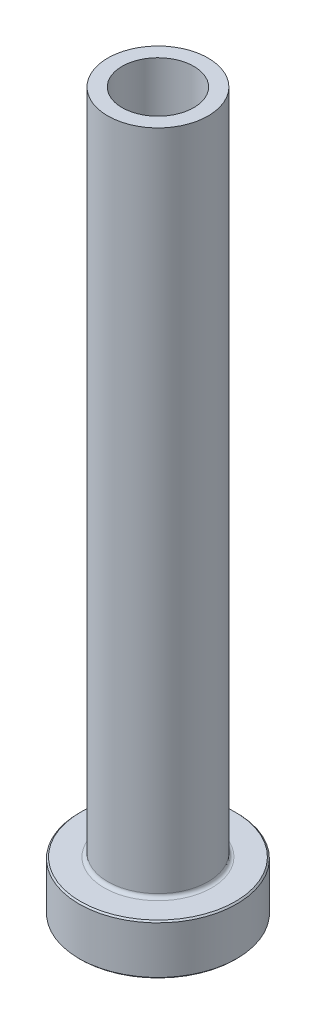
from build123d import *

# Parameters (mm, degrees)
FILLET1_R     = 0.5
CHAMFER1_SIZE = 0.2
CHAMFER3_SIZE = 0.5


with BuildPart() as part:
    # Sketch1 → Revolve1 (revolve)
    with BuildSketch(Plane.XY, mode=Mode.PRIVATE) as revolve1_sk:
        Polygon((-5, 100), (-7, 100), (-7, 7), (-11, 7), (-11, 0), (-5.25, 0), (-5.25, 43), (-5, 55), align=None)
    revolve(revolve1_sk.sketch.rotate(Axis((0, 92.187680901, 0), (0, -1, 0)), 270), axis=Axis((0, 92.187680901, 0), (0, -1, 0)))

    # Fillet1
    fillet1_edges = [part.edges().sort_by_distance(p)[0] for p in [
        (0, 7, -7),
    ]]
    fillet(fillet1_edges, radius=FILLET1_R)

    # Chamfer1
    chamfer1_edges = [part.edges().sort_by_distance(p)[0] for p in [
        (0, 0, -11),
        (0, 7, -11),
    ]]
    chamfer(chamfer1_edges, length=CHAMFER1_SIZE)

    # Chamfer3
    chamfer3_edges = [part.edges().sort_by_distance(p)[0] for p in [
        (0, 0, -5.25),
    ]]
    chamfer(chamfer3_edges, length=CHAMFER3_SIZE)


solid = part.part
